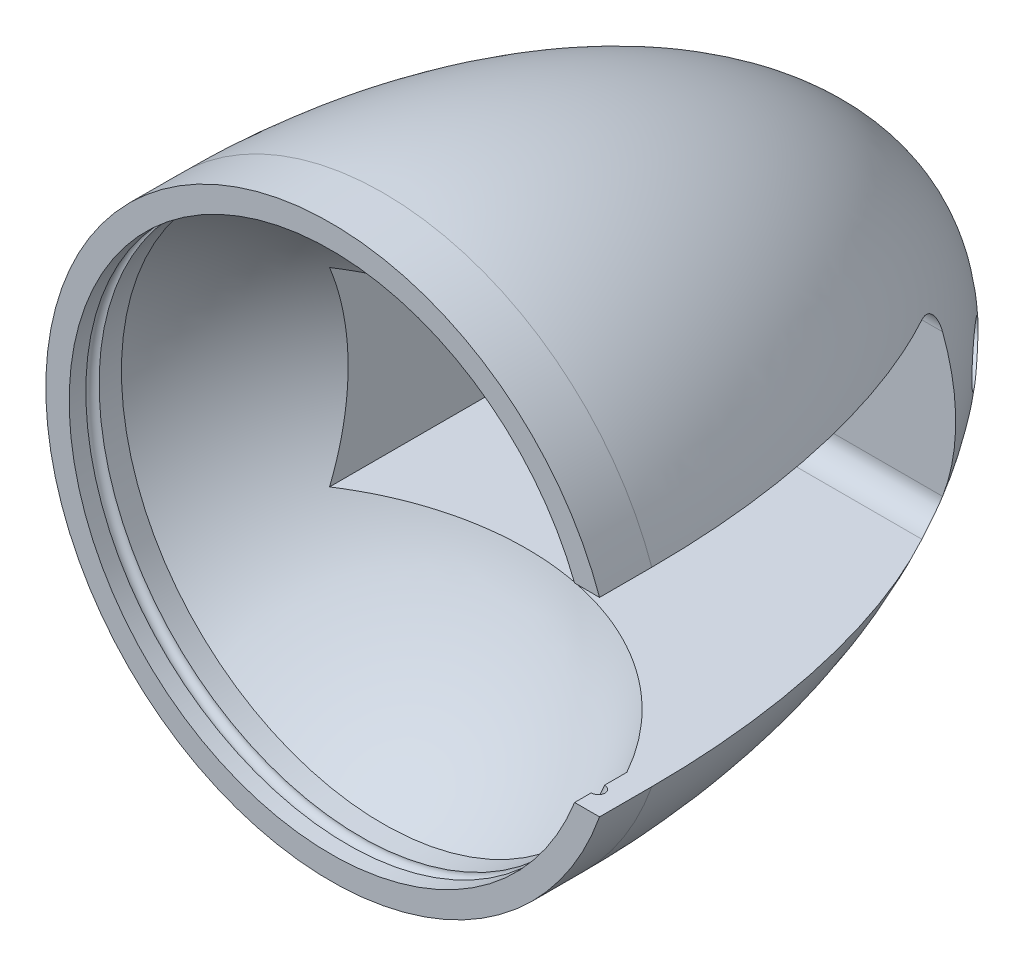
from build123d import *

# Parameters (mm, degrees)
CUT_EXTRUDE2_START      = -1.778
CUT_EXTRUDE2_DEPTH      = 96.622750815
SKETCH2_W               = 4.0005
SKETCH2_H               = 19.05
CUT_EXTRUDE4_DEPTH      = 94.844750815
CUT_EXTRUDE6_DEPTH      = 94.844750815
CUT_EXTRUDE6_DEPTH_BACK = 20.32
CHAMFER1_SIZE           = 1.778
CHAMFER1_SIZE2          = 2.95908892


with BuildPart() as part:
    # Sketch1 one side → Revolve1 (revolve)
    with BuildSketch(Plane(origin=(0, 0, 0), x_dir=(0, 0, -1), z_dir=(1, 0, 0)), mode=Mode.PRIVATE) as revolve1_sk:
        with BuildLine():
            Line((69.3039, 0), (70.485, 0))
            ThreePointArc((70.485, 0), (66.04, 4.445), (61.595, 0))
            Line((61.595, 0), (62.7761, 0))
            ThreePointArc((62.7761, 0), (66.04, 3.2639), (69.3039, 0))
        make_face()
        with BuildLine():
            Line((63.4873, 0), (68.5927, 0))
            ThreePointArc((68.5927, 0), (66.04, 2.5527), (63.4873, 0))
        make_face()
        with BuildLine():
            Line((0, 38.1), (6.985, 38.1))
            add(Edge.make_bspline(
                [(76.835, 0), (76.835, 38.1), (6.985, 38.1)],
                knots=[3.141592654, 3.141592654, 3.141592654, 4.71238898, 4.71238898, 4.71238898], degree=2, weights=[1, 0.707106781, 1]))
            Line((76.835, 0), (28.280423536, 0))
            ThreePointArc((28.280423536, 0), (22.537741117, 20.474384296), (6.985, 34.9758))
            Line((6.985, 34.9758), (4.0005, 34.9758))
            ThreePointArc((4.0005, 34.9758), (3.1115, 35.8648), (2.2225, 34.9758))
            Line((2.2225, 34.9758), (0, 34.9758))
            Line((0, 34.9758), (0, 38.1))
        make_face()
    revolve(revolve1_sk.sketch.rotate(Axis((0, 0, 27.983511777), (0, 0, -1)), 90), axis=Axis((0, 0, 27.983511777), (0, 0, -1)))

    # Sketch1_4 → Cut-Extrude2 (cut, through all)
    with BuildSketch(Plane(origin=(0, 0, 0), x_dir=(0, 0, -1), z_dir=(1, 0, 0)).offset(CUT_EXTRUDE2_START)):
        with BuildLine():
            ThreePointArc((62.7761, 0), (66.04, -3.2639), (69.3039, 0))
            Line((69.3039, 0), (68.5927, 0))
            ThreePointArc((68.5927, 0), (66.04, -2.5527), (63.4873, 0))
            Line((63.4873, 0), (62.7761, 0))
        make_face()
        with BuildLine():
            Line((68.5927, 0), (69.3039, 0))
            ThreePointArc((69.3039, 0), (66.04, 3.2639), (62.7761, 0))
            Line((62.7761, 0), (63.4873, 0))
            ThreePointArc((63.4873, 0), (66.04, 2.5527), (68.5927, 0))
        make_face()
        with BuildLine():
            ThreePointArc((63.4873, 0), (66.04, -2.5527), (68.5927, 0))
            Line((68.5927, 0), (63.4873, 0))
        make_face()
        with BuildLine():
            Line((63.4873, 0), (68.5927, 0))
            ThreePointArc((68.5927, 0), (66.04, 2.5527), (63.4873, 0))
        make_face()
        with BuildLine():
            ThreePointArc((63.4873, 0), (66.04, -2.5527), (68.5927, 0))
            Line((68.5927, 0), (63.4873, 0))
        make_face()
        with BuildLine():
            Line((63.4873, 0), (68.5927, 0))
            ThreePointArc((68.5927, 0), (66.04, 2.5527), (63.4873, 0))
        make_face()
        with BuildLine():
            ThreePointArc((62.7761, 0), (66.04, -3.2639), (69.3039, 0))
            Line((69.3039, 0), (68.5927, 0))
            ThreePointArc((68.5927, 0), (66.04, -2.5527), (63.4873, 0))
            Line((63.4873, 0), (62.7761, 0))
        make_face()
        with BuildLine():
            Line((68.5927, 0), (69.3039, 0))
            ThreePointArc((69.3039, 0), (66.04, 3.2639), (62.7761, 0))
            Line((62.7761, 0), (63.4873, 0))
            ThreePointArc((63.4873, 0), (66.04, 2.5527), (68.5927, 0))
        make_face()
    extrude(amount=CUT_EXTRUDE2_DEPTH, mode=Mode.SUBTRACT)

    # Sketch2 → Cut-Extrude4 (cut, through all)
    with BuildSketch(Plane(origin=(0, 0, 0), x_dir=(0, 0, -1), z_dir=(1, 0, 0))):
        with Locations((2.00025, 0)):
            Rectangle(SKETCH2_W, SKETCH2_H)
    extrude(amount=CUT_EXTRUDE4_DEPTH, mode=Mode.SUBTRACT)

    # Sketch4 → Cut-Extrude6 (cut, two sides: drawn at the far end of the back side and taken through both)
    with BuildSketch(Plane(origin=(0, 0, 0), x_dir=(0, 0, -1), z_dir=(1, 0, 0)).offset(-CUT_EXTRUDE6_DEPTH_BACK)):
        with BuildLine():
            Line((0, 12.7), (53.680423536, 12.7))
            ThreePointArc((53.680423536, 12.7), (55.925487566, 11.77006403), (56.855423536, 9.525))
            Line((56.855423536, 9.525), (56.855423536, -9.525))
            ThreePointArc((56.855423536, -9.525), (55.925487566, -11.77006403), (53.680423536, -12.7))
            Line((53.680423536, -12.7), (0, -12.7))
            Line((0, -12.7), (0, 12.7))
        make_face()
    extrude(amount=CUT_EXTRUDE6_DEPTH + CUT_EXTRUDE6_DEPTH_BACK, mode=Mode.SUBTRACT)

    # Chamfer1
    chamfer1_edges = [part.edges().sort_by_distance(p)[0] for p in [
        (-1.778, 0, -69.3039),
    ]]
    chamfer1_side = [part.faces().sort_by_distance(p)[0] for p in [
        (10.573256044, 0, -69.3039),
    ]]
    chamfer(chamfer1_edges, length=CHAMFER1_SIZE, length2=CHAMFER1_SIZE2, reference=chamfer1_side[0])


solid = part.part
